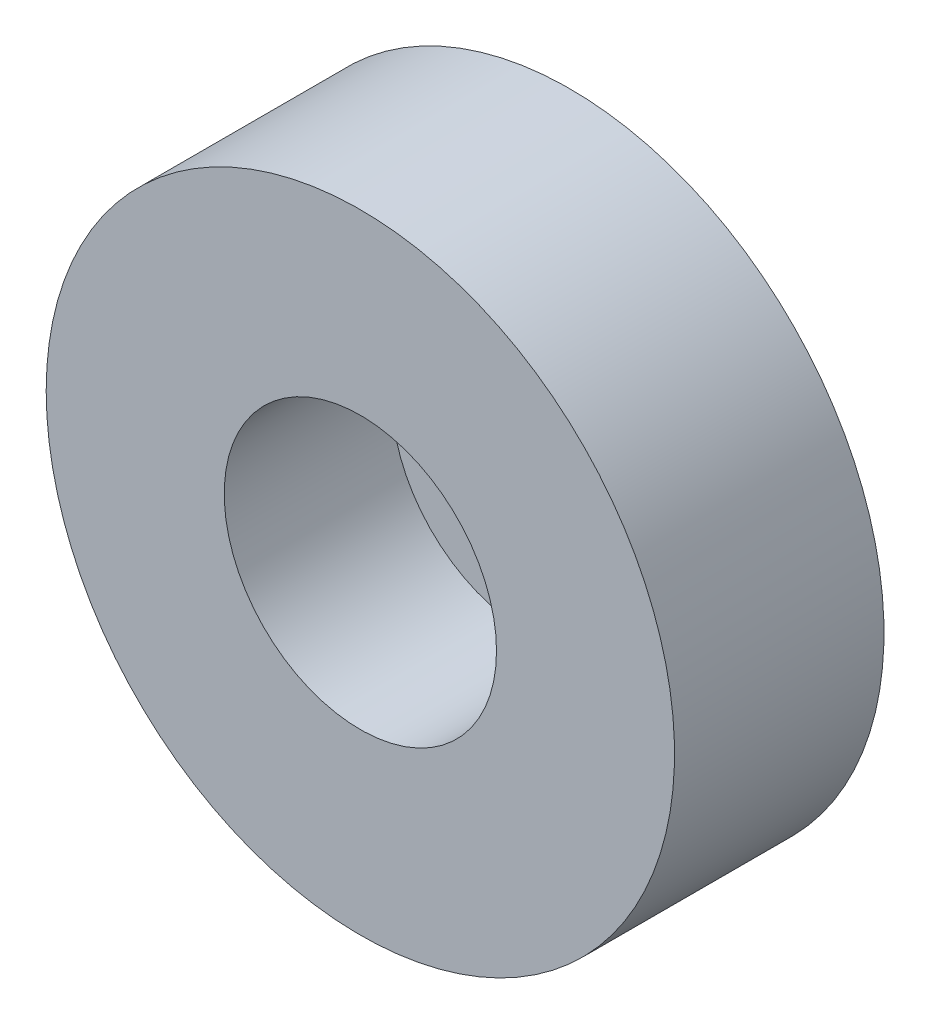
ISO-10303-21;
HEADER;
FILE_DESCRIPTION(('STEP AP214'),'2;1');
FILE_NAME('part.step','',(''),(''),'','','');
FILE_SCHEMA(('AUTOMOTIVE_DESIGN { 1 0 10303 214 1 1 1 1 }'));
ENDSEC;
DATA;
#1=APPLICATION_CONTEXT('core data for automotive mechanical design processes');
#2=APPLICATION_PROTOCOL_DEFINITION('international standard','automotive_design',2000,#1);
#3=PRODUCT_CONTEXT('',#1,'mechanical');
#4=PRODUCT('Part','Part','',(#3));
#5=PRODUCT_RELATED_PRODUCT_CATEGORY('part','',(#4));
#6=PRODUCT_DEFINITION_FORMATION('','',#4);
#7=PRODUCT_DEFINITION_CONTEXT('part definition',#1,'design');
#8=PRODUCT_DEFINITION('design','',#6,#7);
#9=PRODUCT_DEFINITION_SHAPE('','',#8);
#10=(LENGTH_UNIT() NAMED_UNIT(*) SI_UNIT(.MILLI.,.METRE.));
#11=(NAMED_UNIT(*) PLANE_ANGLE_UNIT() SI_UNIT($,.RADIAN.));
#12=(NAMED_UNIT(*) SI_UNIT($,.STERADIAN.) SOLID_ANGLE_UNIT());
#13=UNCERTAINTY_MEASURE_WITH_UNIT(LENGTH_MEASURE(1.E-05),#10,'distance_accuracy_value','');
#14=(GEOMETRIC_REPRESENTATION_CONTEXT(3) GLOBAL_UNCERTAINTY_ASSIGNED_CONTEXT((#13)) GLOBAL_UNIT_ASSIGNED_CONTEXT((#10,
#11,#12)) REPRESENTATION_CONTEXT('',''));
#15=CARTESIAN_POINT('',(0.,0.,0.));
#16=DIRECTION('',(0.,0.,1.));
#17=DIRECTION('',(1.,0.,0.));
#18=AXIS2_PLACEMENT_3D('',#15,#16,#17);
#19=CARTESIAN_POINT('',(0.,0.,4.99999999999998));
#20=DIRECTION('',(0.,0.,-0.999999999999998));
#21=DIRECTION('',(-0.999999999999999,0.,0.));
#22=AXIS2_PLACEMENT_3D('',#19,#20,#21);
#23=CYLINDRICAL_SURFACE('',#22,1.5);
#24=CARTESIAN_POINT('',(0.,0.,0.));
#25=DIRECTION('',(0.,0.,0.999999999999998));
#26=DIRECTION('',(0.999999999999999,0.,0.));
#27=AXIS2_PLACEMENT_3D('',#24,#25,#26);
#28=CIRCLE('',#27,1.5);
#29=CARTESIAN_POINT('',(-1.49999999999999,0.,0.));
#30=VERTEX_POINT('',#29);
#31=EDGE_CURVE('E40',#30,#30,#28,.T.);
#32=CARTESIAN_POINT('',(0.,0.,1.));
#33=DIRECTION('',(0.,0.,0.999999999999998));
#34=DIRECTION('',(0.999999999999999,0.,0.));
#35=AXIS2_PLACEMENT_3D('',#32,#33,#34);
#36=CIRCLE('',#35,1.5);
#37=CARTESIAN_POINT('',(-1.49999999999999,0.,1.));
#38=VERTEX_POINT('',#37);
#39=EDGE_CURVE('E32',#38,#38,#36,.T.);
#40=CARTESIAN_POINT('',(-1.49999999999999,0.,0.));
#41=CARTESIAN_POINT('',(-1.49999999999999,0.,0.0104166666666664));
#42=CARTESIAN_POINT('',(-1.49999999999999,0.,0.0208333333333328));
#43=CARTESIAN_POINT('',(-1.49999999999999,0.,0.0416666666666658));
#44=CARTESIAN_POINT('',(-1.49999999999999,0.,0.0520833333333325));
#45=CARTESIAN_POINT('',(-1.49999999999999,0.,0.0729166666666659));
#46=CARTESIAN_POINT('',(-1.49999999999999,0.,0.0833333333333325));
#47=CARTESIAN_POINT('',(-1.49999999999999,0.,0.104166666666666));
#48=CARTESIAN_POINT('',(-1.49999999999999,0.,0.114583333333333));
#49=CARTESIAN_POINT('',(-1.49999999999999,0.,0.135416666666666));
#50=CARTESIAN_POINT('',(-1.49999999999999,0.,0.145833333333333));
#51=CARTESIAN_POINT('',(-1.49999999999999,0.,0.166666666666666));
#52=CARTESIAN_POINT('',(-1.49999999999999,0.,0.177083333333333));
#53=CARTESIAN_POINT('',(-1.49999999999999,0.,0.197916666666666));
#54=CARTESIAN_POINT('',(-1.49999999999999,0.,0.208333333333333));
#55=CARTESIAN_POINT('',(-1.49999999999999,0.,0.229166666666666));
#56=CARTESIAN_POINT('',(-1.49999999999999,0.,0.239583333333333));
#57=CARTESIAN_POINT('',(-1.49999999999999,0.,0.260416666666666));
#58=CARTESIAN_POINT('',(-1.49999999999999,0.,0.270833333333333));
#59=CARTESIAN_POINT('',(-1.49999999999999,0.,0.291666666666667));
#60=CARTESIAN_POINT('',(-1.49999999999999,0.,0.302083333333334));
#61=CARTESIAN_POINT('',(-1.49999999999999,0.,0.322916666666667));
#62=CARTESIAN_POINT('',(-1.49999999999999,0.,0.333333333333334));
#63=CARTESIAN_POINT('',(-1.49999999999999,0.,0.354166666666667));
#64=CARTESIAN_POINT('',(-1.49999999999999,0.,0.364583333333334));
#65=CARTESIAN_POINT('',(-1.49999999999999,0.,0.385416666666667));
#66=CARTESIAN_POINT('',(-1.49999999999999,0.,0.395833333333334));
#67=CARTESIAN_POINT('',(-1.49999999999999,0.,0.416666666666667));
#68=CARTESIAN_POINT('',(-1.49999999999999,0.,0.427083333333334));
#69=CARTESIAN_POINT('',(-1.49999999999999,0.,0.447916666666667));
#70=CARTESIAN_POINT('',(-1.49999999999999,0.,0.458333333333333));
#71=CARTESIAN_POINT('',(-1.49999999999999,0.,0.479166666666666));
#72=CARTESIAN_POINT('',(-1.49999999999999,0.,0.489583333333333));
#73=CARTESIAN_POINT('',(-1.49999999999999,0.,0.510416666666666));
#74=CARTESIAN_POINT('',(-1.49999999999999,0.,0.520833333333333));
#75=CARTESIAN_POINT('',(-1.49999999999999,0.,0.541666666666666));
#76=CARTESIAN_POINT('',(-1.49999999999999,0.,0.552083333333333));
#77=CARTESIAN_POINT('',(-1.49999999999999,0.,0.572916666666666));
#78=CARTESIAN_POINT('',(-1.49999999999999,0.,0.583333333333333));
#79=CARTESIAN_POINT('',(-1.49999999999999,0.,0.604166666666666));
#80=CARTESIAN_POINT('',(-1.49999999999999,0.,0.614583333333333));
#81=CARTESIAN_POINT('',(-1.49999999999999,0.,0.635416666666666));
#82=CARTESIAN_POINT('',(-1.49999999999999,0.,0.645833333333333));
#83=CARTESIAN_POINT('',(-1.49999999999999,0.,0.666666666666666));
#84=CARTESIAN_POINT('',(-1.49999999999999,0.,0.677083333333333));
#85=CARTESIAN_POINT('',(-1.49999999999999,0.,0.697916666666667));
#86=CARTESIAN_POINT('',(-1.49999999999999,0.,0.708333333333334));
#87=CARTESIAN_POINT('',(-1.49999999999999,0.,0.729166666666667));
#88=CARTESIAN_POINT('',(-1.49999999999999,0.,0.739583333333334));
#89=CARTESIAN_POINT('',(-1.49999999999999,0.,0.760416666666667));
#90=CARTESIAN_POINT('',(-1.49999999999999,0.,0.770833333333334));
#91=CARTESIAN_POINT('',(-1.49999999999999,0.,0.791666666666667));
#92=CARTESIAN_POINT('',(-1.49999999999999,0.,0.802083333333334));
#93=CARTESIAN_POINT('',(-1.49999999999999,0.,0.822916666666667));
#94=CARTESIAN_POINT('',(-1.49999999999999,0.,0.833333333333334));
#95=CARTESIAN_POINT('',(-1.49999999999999,0.,0.854166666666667));
#96=CARTESIAN_POINT('',(-1.49999999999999,0.,0.864583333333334));
#97=CARTESIAN_POINT('',(-1.49999999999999,0.,0.885416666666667));
#98=CARTESIAN_POINT('',(-1.49999999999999,0.,0.895833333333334));
#99=CARTESIAN_POINT('',(-1.49999999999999,0.,0.916666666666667));
#100=CARTESIAN_POINT('',(-1.49999999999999,0.,0.927083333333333));
#101=CARTESIAN_POINT('',(-1.49999999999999,0.,0.947916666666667));
#102=CARTESIAN_POINT('',(-1.49999999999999,0.,0.958333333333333));
#103=CARTESIAN_POINT('',(-1.49999999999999,0.,0.979166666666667));
#104=CARTESIAN_POINT('',(-1.49999999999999,0.,0.989583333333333));
#105=CARTESIAN_POINT('',(-1.49999999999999,0.,1.));
#106=B_SPLINE_CURVE_WITH_KNOTS('',3,(#40,#41,#42,#43,#44,#45,#46,#47,#48,#49,#50,#51,#52,#53,
#54,#55,#56,#57,#58,#59,#60,#61,#62,#63,#64,#65,#66,#67,#68,#69,#70,#71,#72,#73,#74,#75,#76,#77,
#78,#79,#80,#81,#82,#83,#84,#85,#86,#87,#88,#89,#90,#91,#92,#93,#94,#95,#96,#97,#98,#99,#100,
#101,#102,#103,#104,#105),.UNSPECIFIED.,.F.,.F.,(4,2,2,2,2,2,2,2,2,2,2,2,2,2,2,2,2,2,2,2,2,2,2,
2,2,2,2,2,2,2,2,2,4),(0.,0.0312499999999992,0.0624999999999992,0.0937499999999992,
0.124999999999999,0.156249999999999,0.187499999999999,0.218749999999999,0.249999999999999,
0.28125,0.3125,0.34375,0.375,0.40625,0.4375,0.46875,0.5,0.53125,0.5625,0.59375,0.625,0.65625,
0.6875,0.718750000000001,0.750000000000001,0.781250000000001,0.812500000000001,
0.843750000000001,0.875000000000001,0.90625,0.9375,0.96875,1.),.UNSPECIFIED.);
#107=EDGE_CURVE('BSEAM28',#30,#38,#106,.T.);
#108=ORIENTED_EDGE('',*,*,#31,.F.);
#109=ORIENTED_EDGE('',*,*,#39,.T.);
#110=ORIENTED_EDGE('',*,*,#107,.T.);
#111=ORIENTED_EDGE('',*,*,#107,.F.);
#112=EDGE_LOOP('',(#108,#110,#109,#111));
#113=FACE_BOUND('',#112,.T.);
#114=ADVANCED_FACE('F28',(#113),#23,.F.);
#115=CARTESIAN_POINT('',(0.,0.,4.99999999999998));
#116=DIRECTION('',(0.,0.,0.999999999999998));
#117=DIRECTION('',(0.999999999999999,0.,0.));
#118=AXIS2_PLACEMENT_3D('',#115,#116,#117);
#119=PLANE('',#118);
#120=CARTESIAN_POINT('',(0.,0.,4.99999999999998));
#121=DIRECTION('',(0.,0.,0.999999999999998));
#122=DIRECTION('',(0.999999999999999,0.,0.));
#123=AXIS2_PLACEMENT_3D('',#120,#121,#122);
#124=CIRCLE('',#123,3.25);
#125=CARTESIAN_POINT('',(3.25,0.,4.99999999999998));
#126=VERTEX_POINT('',#125);
#127=EDGE_CURVE('E48',#126,#126,#124,.T.);
#128=ORIENTED_EDGE('',*,*,#127,.F.);
#129=EDGE_LOOP('',(#128));
#130=FACE_BOUND('',#129,.T.);
#131=CARTESIAN_POINT('',(0.,0.,4.99999999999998));
#132=DIRECTION('',(0.,0.,0.999999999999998));
#133=DIRECTION('',(0.999999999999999,0.,0.));
#134=AXIS2_PLACEMENT_3D('',#131,#132,#133);
#135=CIRCLE('',#134,7.5);
#136=CARTESIAN_POINT('',(-7.49999999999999,0.,4.99999999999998));
#137=VERTEX_POINT('',#136);
#138=EDGE_CURVE('E10',#137,#137,#135,.T.);
#139=ORIENTED_EDGE('',*,*,#138,.T.);
#140=EDGE_LOOP('',(#139));
#141=FACE_BOUND('',#140,.T.);
#142=ADVANCED_FACE('F54',(#130,#141),#119,.T.);
#143=CARTESIAN_POINT('',(0.,0.,0.));
#144=DIRECTION('',(0.,0.,0.999999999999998));
#145=DIRECTION('',(0.999999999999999,0.,0.));
#146=AXIS2_PLACEMENT_3D('',#143,#144,#145);
#147=PLANE('',#146);
#148=CARTESIAN_POINT('',(0.,0.,0.));
#149=DIRECTION('',(0.,0.,0.999999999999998));
#150=DIRECTION('',(0.999999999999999,0.,0.));
#151=AXIS2_PLACEMENT_3D('',#148,#149,#150);
#152=CIRCLE('',#151,7.5);
#153=CARTESIAN_POINT('',(-7.49999999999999,0.,0.));
#154=VERTEX_POINT('',#153);
#155=EDGE_CURVE('E36',#154,#154,#152,.T.);
#156=ORIENTED_EDGE('',*,*,#155,.F.);
#157=EDGE_LOOP('',(#156));
#158=FACE_BOUND('',#157,.T.);
#159=ORIENTED_EDGE('',*,*,#31,.T.);
#160=EDGE_LOOP('',(#159));
#161=FACE_BOUND('',#160,.T.);
#162=ADVANCED_FACE('F56',(#158,#161),#147,.F.);
#163=CARTESIAN_POINT('',(0.,0.,4.99999999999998));
#164=DIRECTION('',(0.,0.,-0.999999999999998));
#165=DIRECTION('',(-0.999999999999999,0.,0.));
#166=AXIS2_PLACEMENT_3D('',#163,#164,#165);
#167=CYLINDRICAL_SURFACE('',#166,7.5);
#168=CARTESIAN_POINT('',(-7.49999999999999,0.,4.99999999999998));
#169=CARTESIAN_POINT('',(-7.49999999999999,0.,4.94791666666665));
#170=CARTESIAN_POINT('',(-7.49999999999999,0.,4.89583333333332));
#171=CARTESIAN_POINT('',(-7.49999999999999,0.,4.79166666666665));
#172=CARTESIAN_POINT('',(-7.49999999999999,0.,4.73958333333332));
#173=CARTESIAN_POINT('',(-7.49999999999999,0.,4.63541666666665));
#174=CARTESIAN_POINT('',(-7.49999999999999,0.,4.58333333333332));
#175=CARTESIAN_POINT('',(-7.49999999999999,0.,4.47916666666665));
#176=CARTESIAN_POINT('',(-7.49999999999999,0.,4.42708333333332));
#177=CARTESIAN_POINT('',(-7.49999999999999,0.,4.32291666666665));
#178=CARTESIAN_POINT('',(-7.49999999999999,0.,4.27083333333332));
#179=CARTESIAN_POINT('',(-7.49999999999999,0.,4.16666666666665));
#180=CARTESIAN_POINT('',(-7.49999999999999,0.,4.11458333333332));
#181=CARTESIAN_POINT('',(-7.49999999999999,0.,4.01041666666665));
#182=CARTESIAN_POINT('',(-7.49999999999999,0.,3.95833333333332));
#183=CARTESIAN_POINT('',(-7.49999999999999,0.,3.85416666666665));
#184=CARTESIAN_POINT('',(-7.49999999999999,0.,3.80208333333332));
#185=CARTESIAN_POINT('',(-7.49999999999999,0.,3.69791666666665));
#186=CARTESIAN_POINT('',(-7.49999999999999,0.,3.64583333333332));
#187=CARTESIAN_POINT('',(-7.49999999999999,0.,3.54166666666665));
#188=CARTESIAN_POINT('',(-7.49999999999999,0.,3.48958333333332));
#189=CARTESIAN_POINT('',(-7.49999999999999,0.,3.38541666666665));
#190=CARTESIAN_POINT('',(-7.49999999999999,0.,3.33333333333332));
#191=CARTESIAN_POINT('',(-7.49999999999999,0.,3.22916666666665));
#192=CARTESIAN_POINT('',(-7.49999999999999,0.,3.17708333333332));
#193=CARTESIAN_POINT('',(-7.49999999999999,0.,3.07291666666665));
#194=CARTESIAN_POINT('',(-7.49999999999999,0.,3.02083333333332));
#195=CARTESIAN_POINT('',(-7.49999999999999,0.,2.91666666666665));
#196=CARTESIAN_POINT('',(-7.49999999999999,0.,2.86458333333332));
#197=CARTESIAN_POINT('',(-7.49999999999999,0.,2.76041666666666));
#198=CARTESIAN_POINT('',(-7.49999999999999,0.,2.70833333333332));
#199=CARTESIAN_POINT('',(-7.49999999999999,0.,2.60416666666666));
#200=CARTESIAN_POINT('',(-7.49999999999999,0.,2.55208333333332));
#201=CARTESIAN_POINT('',(-7.49999999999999,0.,2.44791666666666));
#202=CARTESIAN_POINT('',(-7.49999999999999,0.,2.39583333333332));
#203=CARTESIAN_POINT('',(-7.49999999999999,0.,2.29166666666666));
#204=CARTESIAN_POINT('',(-7.49999999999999,0.,2.23958333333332));
#205=CARTESIAN_POINT('',(-7.49999999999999,0.,2.13541666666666));
#206=CARTESIAN_POINT('',(-7.49999999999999,0.,2.08333333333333));
#207=CARTESIAN_POINT('',(-7.49999999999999,0.,1.97916666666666));
#208=CARTESIAN_POINT('',(-7.49999999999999,0.,1.92708333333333));
#209=CARTESIAN_POINT('',(-7.49999999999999,0.,1.82291666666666));
#210=CARTESIAN_POINT('',(-7.49999999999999,0.,1.77083333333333));
#211=CARTESIAN_POINT('',(-7.49999999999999,0.,1.66666666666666));
#212=CARTESIAN_POINT('',(-7.49999999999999,0.,1.61458333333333));
#213=CARTESIAN_POINT('',(-7.49999999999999,0.,1.51041666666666));
#214=CARTESIAN_POINT('',(-7.49999999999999,0.,1.45833333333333));
#215=CARTESIAN_POINT('',(-7.49999999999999,0.,1.35416666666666));
#216=CARTESIAN_POINT('',(-7.49999999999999,0.,1.30208333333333));
#217=CARTESIAN_POINT('',(-7.49999999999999,0.,1.19791666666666));
#218=CARTESIAN_POINT('',(-7.49999999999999,0.,1.14583333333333));
#219=CARTESIAN_POINT('',(-7.49999999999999,0.,1.04166666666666));
#220=CARTESIAN_POINT('',(-7.49999999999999,0.,0.989583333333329));
#221=CARTESIAN_POINT('',(-7.49999999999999,0.,0.885416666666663));
#222=CARTESIAN_POINT('',(-7.49999999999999,0.,0.83333333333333));
#223=CARTESIAN_POINT('',(-7.49999999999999,0.,0.729166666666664));
#224=CARTESIAN_POINT('',(-7.49999999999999,0.,0.67708333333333));
#225=CARTESIAN_POINT('',(-7.49999999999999,0.,0.572916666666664));
#226=CARTESIAN_POINT('',(-7.49999999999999,0.,0.520833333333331));
#227=CARTESIAN_POINT('',(-7.49999999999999,0.,0.416666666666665));
#228=CARTESIAN_POINT('',(-7.49999999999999,0.,0.364583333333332));
#229=CARTESIAN_POINT('',(-7.49999999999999,0.,0.260416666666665));
#230=CARTESIAN_POINT('',(-7.49999999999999,0.,0.208333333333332));
#231=CARTESIAN_POINT('',(-7.49999999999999,0.,0.104166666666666));
#232=CARTESIAN_POINT('',(-7.49999999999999,0.,0.0520833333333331));
#233=CARTESIAN_POINT('',(-7.49999999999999,0.,0.));
#234=B_SPLINE_CURVE_WITH_KNOTS('',3,(#168,#169,#170,#171,#172,#173,#174,#175,#176,#177,#178,
#179,#180,#181,#182,#183,#184,#185,#186,#187,#188,#189,#190,#191,#192,#193,#194,#195,#196,#197,
#198,#199,#200,#201,#202,#203,#204,#205,#206,#207,#208,#209,#210,#211,#212,#213,#214,#215,#216,
#217,#218,#219,#220,#221,#222,#223,#224,#225,#226,#227,#228,#229,#230,#231,#232,#233),
.UNSPECIFIED.,.F.,.F.,(4,2,2,2,2,2,2,2,2,2,2,2,2,2,2,2,2,2,2,2,2,2,2,2,2,2,2,2,2,2,2,2,4),(0.,
0.15625,0.312499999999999,0.468749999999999,0.624999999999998,0.781249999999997,
0.937499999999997,1.09375,1.25,1.40625,1.56249999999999,1.71874999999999,1.87499999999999,
2.03124999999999,2.18749999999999,2.34374999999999,2.49999999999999,2.65624999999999,
2.81249999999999,2.96874999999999,3.12499999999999,3.28124999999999,3.43749999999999,
3.59374999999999,3.74999999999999,3.90624999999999,4.06249999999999,4.21874999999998,
4.37499999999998,4.53124999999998,4.68749999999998,4.84374999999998,4.99999999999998),.UNSPECIFIED.);
#235=EDGE_CURVE('BSEAM30',#137,#154,#234,.T.);
#236=ORIENTED_EDGE('',*,*,#138,.F.);
#237=ORIENTED_EDGE('',*,*,#155,.T.);
#238=ORIENTED_EDGE('',*,*,#235,.T.);
#239=ORIENTED_EDGE('',*,*,#235,.F.);
#240=EDGE_LOOP('',(#236,#238,#237,#239));
#241=FACE_BOUND('',#240,.T.);
#242=ADVANCED_FACE('F30',(#241),#167,.T.);
#243=CARTESIAN_POINT('',(0.,0.,1.));
#244=DIRECTION('',(0.,0.,0.999999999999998));
#245=DIRECTION('',(0.999999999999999,0.,0.));
#246=AXIS2_PLACEMENT_3D('',#243,#244,#245);
#247=CYLINDRICAL_SURFACE('',#246,3.25);
#248=CARTESIAN_POINT('',(0.,0.,1.));
#249=DIRECTION('',(0.,0.,0.999999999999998));
#250=DIRECTION('',(0.999999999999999,0.,0.));
#251=AXIS2_PLACEMENT_3D('',#248,#249,#250);
#252=CIRCLE('',#251,3.25);
#253=CARTESIAN_POINT('',(3.25,0.,1.));
#254=VERTEX_POINT('',#253);
#255=EDGE_CURVE('E45',#254,#254,#252,.T.);
#256=CARTESIAN_POINT('',(3.25,0.,1.));
#257=CARTESIAN_POINT('',(3.25,0.,1.04166666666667));
#258=CARTESIAN_POINT('',(3.25,0.,1.08333333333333));
#259=CARTESIAN_POINT('',(3.25,0.,1.16666666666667));
#260=CARTESIAN_POINT('',(3.25,0.,1.20833333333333));
#261=CARTESIAN_POINT('',(3.25,0.,1.29166666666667));
#262=CARTESIAN_POINT('',(3.25,0.,1.33333333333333));
#263=CARTESIAN_POINT('',(3.25,0.,1.41666666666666));
#264=CARTESIAN_POINT('',(3.25,0.,1.45833333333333));
#265=CARTESIAN_POINT('',(3.25,0.,1.54166666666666));
#266=CARTESIAN_POINT('',(3.25,0.,1.58333333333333));
#267=CARTESIAN_POINT('',(3.25,0.,1.66666666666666));
#268=CARTESIAN_POINT('',(3.25,0.,1.70833333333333));
#269=CARTESIAN_POINT('',(3.25,0.,1.79166666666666));
#270=CARTESIAN_POINT('',(3.25,0.,1.83333333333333));
#271=CARTESIAN_POINT('',(3.25,0.,1.91666666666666));
#272=CARTESIAN_POINT('',(3.25,0.,1.95833333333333));
#273=CARTESIAN_POINT('',(3.25,0.,2.04166666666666));
#274=CARTESIAN_POINT('',(3.25,0.,2.08333333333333));
#275=CARTESIAN_POINT('',(3.25,0.,2.16666666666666));
#276=CARTESIAN_POINT('',(3.25,0.,2.20833333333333));
#277=CARTESIAN_POINT('',(3.25,0.,2.29166666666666));
#278=CARTESIAN_POINT('',(3.25,0.,2.33333333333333));
#279=CARTESIAN_POINT('',(3.25,0.,2.41666666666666));
#280=CARTESIAN_POINT('',(3.25,0.,2.45833333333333));
#281=CARTESIAN_POINT('',(3.25,0.,2.54166666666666));
#282=CARTESIAN_POINT('',(3.25,0.,2.58333333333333));
#283=CARTESIAN_POINT('',(3.25,0.,2.66666666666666));
#284=CARTESIAN_POINT('',(3.25,0.,2.70833333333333));
#285=CARTESIAN_POINT('',(3.25,0.,2.79166666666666));
#286=CARTESIAN_POINT('',(3.25,0.,2.83333333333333));
#287=CARTESIAN_POINT('',(3.25,0.,2.91666666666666));
#288=CARTESIAN_POINT('',(3.25,0.,2.95833333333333));
#289=CARTESIAN_POINT('',(3.25,0.,3.04166666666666));
#290=CARTESIAN_POINT('',(3.25,0.,3.08333333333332));
#291=CARTESIAN_POINT('',(3.25,0.,3.16666666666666));
#292=CARTESIAN_POINT('',(3.25,0.,3.20833333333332));
#293=CARTESIAN_POINT('',(3.25,0.,3.29166666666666));
#294=CARTESIAN_POINT('',(3.25,0.,3.33333333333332));
#295=CARTESIAN_POINT('',(3.25,0.,3.41666666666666));
#296=CARTESIAN_POINT('',(3.25,0.,3.45833333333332));
#297=CARTESIAN_POINT('',(3.25,0.,3.54166666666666));
#298=CARTESIAN_POINT('',(3.25,0.,3.58333333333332));
#299=CARTESIAN_POINT('',(3.25,0.,3.66666666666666));
#300=CARTESIAN_POINT('',(3.25,0.,3.70833333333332));
#301=CARTESIAN_POINT('',(3.25,0.,3.79166666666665));
#302=CARTESIAN_POINT('',(3.25,0.,3.83333333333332));
#303=CARTESIAN_POINT('',(3.25,0.,3.91666666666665));
#304=CARTESIAN_POINT('',(3.25,0.,3.95833333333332));
#305=CARTESIAN_POINT('',(3.25,0.,4.04166666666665));
#306=CARTESIAN_POINT('',(3.25,0.,4.08333333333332));
#307=CARTESIAN_POINT('',(3.25,0.,4.16666666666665));
#308=CARTESIAN_POINT('',(3.25,0.,4.20833333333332));
#309=CARTESIAN_POINT('',(3.25,0.,4.29166666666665));
#310=CARTESIAN_POINT('',(3.25,0.,4.33333333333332));
#311=CARTESIAN_POINT('',(3.25,0.,4.41666666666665));
#312=CARTESIAN_POINT('',(3.25,0.,4.45833333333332));
#313=CARTESIAN_POINT('',(3.25,0.,4.54166666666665));
#314=CARTESIAN_POINT('',(3.25,0.,4.58333333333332));
#315=CARTESIAN_POINT('',(3.25,0.,4.66666666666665));
#316=CARTESIAN_POINT('',(3.25,0.,4.70833333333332));
#317=CARTESIAN_POINT('',(3.25,0.,4.79166666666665));
#318=CARTESIAN_POINT('',(3.25,0.,4.83333333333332));
#319=CARTESIAN_POINT('',(3.25,0.,4.91666666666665));
#320=CARTESIAN_POINT('',(3.25,0.,4.95833333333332));
#321=CARTESIAN_POINT('',(3.25,0.,4.99999999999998));
#322=B_SPLINE_CURVE_WITH_KNOTS('',3,(#256,#257,#258,#259,#260,#261,#262,#263,#264,#265,#266,
#267,#268,#269,#270,#271,#272,#273,#274,#275,#276,#277,#278,#279,#280,#281,#282,#283,#284,#285,
#286,#287,#288,#289,#290,#291,#292,#293,#294,#295,#296,#297,#298,#299,#300,#301,#302,#303,#304,
#305,#306,#307,#308,#309,#310,#311,#312,#313,#314,#315,#316,#317,#318,#319,#320,#321),
.UNSPECIFIED.,.F.,.F.,(4,2,2,2,2,2,2,2,2,2,2,2,2,2,2,2,2,2,2,2,2,2,2,2,2,2,2,2,2,2,2,2,4),(0.,
0.124999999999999,0.249999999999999,0.374999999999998,0.499999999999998,0.624999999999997,
0.749999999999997,0.874999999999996,0.999999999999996,1.125,1.24999999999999,1.37499999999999,
1.49999999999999,1.62499999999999,1.74999999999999,1.87499999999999,1.99999999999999,
2.12499999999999,2.24999999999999,2.37499999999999,2.49999999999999,2.62499999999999,
2.74999999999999,2.87499999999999,2.99999999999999,3.12499999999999,3.24999999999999,
3.37499999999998,3.49999999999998,3.62499999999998,3.74999999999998,3.87499999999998,
3.99999999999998),.UNSPECIFIED.);
#323=EDGE_CURVE('BSEAM52',#254,#126,#322,.T.);
#324=ORIENTED_EDGE('',*,*,#255,.F.);
#325=ORIENTED_EDGE('',*,*,#127,.T.);
#326=ORIENTED_EDGE('',*,*,#323,.T.);
#327=ORIENTED_EDGE('',*,*,#323,.F.);
#328=EDGE_LOOP('',(#324,#326,#325,#327));
#329=FACE_BOUND('',#328,.T.);
#330=ADVANCED_FACE('F52',(#329),#247,.F.);
#331=CARTESIAN_POINT('',(0.,0.,1.));
#332=DIRECTION('',(0.,0.,0.999999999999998));
#333=DIRECTION('',(0.999999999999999,0.,0.));
#334=AXIS2_PLACEMENT_3D('',#331,#332,#333);
#335=PLANE('',#334);
#336=ORIENTED_EDGE('',*,*,#39,.F.);
#337=EDGE_LOOP('',(#336));
#338=FACE_BOUND('',#337,.T.);
#339=ORIENTED_EDGE('',*,*,#255,.T.);
#340=EDGE_LOOP('',(#339));
#341=FACE_BOUND('',#340,.T.);
#342=ADVANCED_FACE('F68',(#338,#341),#335,.T.);
#343=CLOSED_SHELL('',(#114,#142,#162,#242,#330,#342));
#344=MANIFOLD_SOLID_BREP('B2',#343);
#345=ADVANCED_BREP_SHAPE_REPRESENTATION('',(#18,#344),#14);
#346=SHAPE_DEFINITION_REPRESENTATION(#9,#345);
ENDSEC;
END-ISO-10303-21;
